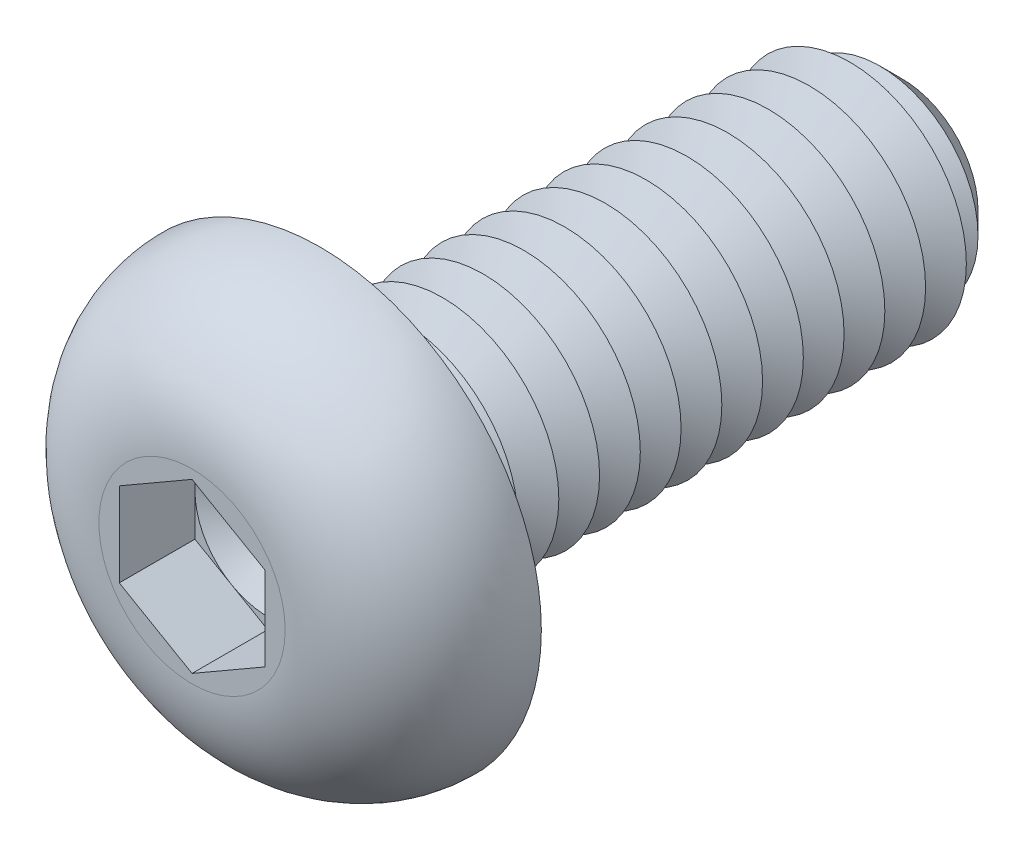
from build123d import *

# Parameters (mm, degrees)
CUT_EXTRUDE1_DEPTH  = 1.3
SKETCH4_R           = 2
BOSS_EXTRUDE1_DEPTH = 10
CHAMFER1_SIZE       = 0.7
LPATTERN1_COUNT     = 13
LPATTERN1_PITCH     = 0.7
FILLET2_R           = 0.3


with BuildPart() as part:
    # Sketch2 → Revolve1 (revolve)
    with BuildSketch(Plane(origin=(0, 0, 0), x_dir=(0, 0, -1), z_dir=(1, 0, 0)), mode=Mode.PRIVATE) as revolve1_sk:
        with BuildLine():
            Line((0, 0), (-2.2, 0))
            Line((-2.2, 0), (-2.2, 1.6))
            ThreePointArc((-2.2, 1.6), (-1.555634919, 3.155634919), (0, 3.8))
            Line((0, 3.8), (0, 0))
        make_face()
    revolve(revolve1_sk.sketch.rotate(Axis((0, 0, 47.934239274), (0, 0, -1)), 90), axis=Axis((0, 0, 47.934239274), (0, 0, -1)))

    # Sketch3 → Cut-Extrude1 (cut)
    with BuildSketch(Plane.XY.offset(2.2)):
        Polygon((0, 1.443375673), (-1.25, 0.721687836), (-1.25, -0.721687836), (0, -1.443375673), (1.25, -0.721687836), (1.25, 0.721687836), align=None)
    extrude(amount=-CUT_EXTRUDE1_DEPTH, mode=Mode.SUBTRACT)

    # Sketch4 → Boss-Extrude1 (add)
    with BuildSketch(Plane(origin=(0, 0, 0), x_dir=(-1, 0, 0), z_dir=(0, 0, -1))):
        with Locations(Location((0, 0, 0), (0, 0, 180))):
            Circle(SKETCH4_R)
    extrude(amount=BOSS_EXTRUDE1_DEPTH)

    # Chamfer1
    chamfer1_edges = [part.edges().sort_by_distance(p)[0] for p in [
        (-2, 0, -10),
    ]]
    chamfer(chamfer1_edges, length=CHAMFER1_SIZE)

    # Sketch5 → Cut-Revolve1 (revolve, cut)
    with BuildSketch(Plane(origin=(0, 0, 0), x_dir=(0, 0, -1), z_dir=(1, 0, 0)), mode=Mode.PRIVATE) as cut_revolve1_sk:
        Polygon((0.7, 2), (1.4, 2), (1.05, 1.393782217), align=None)
    cut_revolve1 = revolve(cut_revolve1_sk.sketch.rotate(Axis((0, 0, 47.934239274), (0, 0, -1)), 90), axis=Axis((0, 0, 47.934239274), (0, 0, -1)), mode=Mode.SUBTRACT)

    # LPattern1: Cut-Revolve1 ×13
    with Locations(*[(0, 0, -i * LPATTERN1_PITCH) for i in range(1, LPATTERN1_COUNT)]):
        add(cut_revolve1, mode=Mode.SUBTRACT)

    # Fillet2
    fillet2_edges = [part.edges().sort_by_distance(p)[0] for p in [
        (-2, 0, 0),
    ]]
    fillet(fillet2_edges, radius=FILLET2_R)

    # Cut-Extrude2 cone 1 section (on through the dimple's axis) → Cut-Extrude2 (revolve, cut)
    with BuildSketch(Plane(origin=(0, 0, 0.9), x_dir=(0, -1, 0), z_dir=(1, 0, 0))):
        Polygon((0, 0), (1.25, 0), (0, 0.721687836), align=None)
    revolve(axis=Axis((0, 0, 0.9), (0, 0, -1)), mode=Mode.SUBTRACT)


solid = part.part
